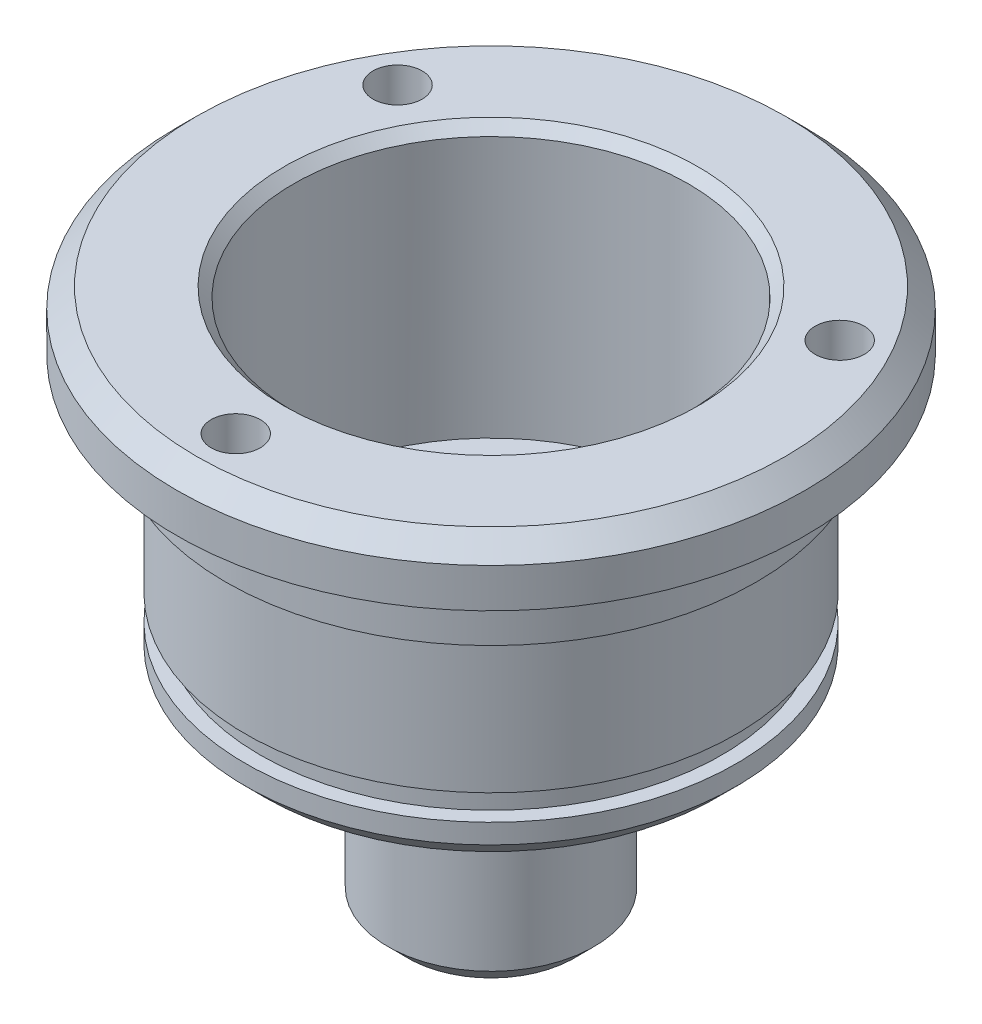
ISO-10303-21;
HEADER;
FILE_DESCRIPTION(('STEP AP214'),'2;1');
FILE_NAME('part.step','',(''),(''),'','','');
FILE_SCHEMA(('AUTOMOTIVE_DESIGN { 1 0 10303 214 1 1 1 1 }'));
ENDSEC;
DATA;
#1=APPLICATION_CONTEXT('core data for automotive mechanical design processes');
#2=APPLICATION_PROTOCOL_DEFINITION('international standard','automotive_design',2000,#1);
#3=PRODUCT_CONTEXT('',#1,'mechanical');
#4=PRODUCT('Part','Part','',(#3));
#5=PRODUCT_RELATED_PRODUCT_CATEGORY('part','',(#4));
#6=PRODUCT_DEFINITION_FORMATION('','',#4);
#7=PRODUCT_DEFINITION_CONTEXT('part definition',#1,'design');
#8=PRODUCT_DEFINITION('design','',#6,#7);
#9=PRODUCT_DEFINITION_SHAPE('','',#8);
#10=(LENGTH_UNIT() NAMED_UNIT(*) SI_UNIT(.MILLI.,.METRE.));
#11=(NAMED_UNIT(*) PLANE_ANGLE_UNIT() SI_UNIT($,.RADIAN.));
#12=(NAMED_UNIT(*) SI_UNIT($,.STERADIAN.) SOLID_ANGLE_UNIT());
#13=UNCERTAINTY_MEASURE_WITH_UNIT(LENGTH_MEASURE(1.E-05),#10,'distance_accuracy_value','');
#14=(GEOMETRIC_REPRESENTATION_CONTEXT(3) GLOBAL_UNCERTAINTY_ASSIGNED_CONTEXT((#13)) GLOBAL_UNIT_ASSIGNED_CONTEXT((#10,
#11,#12)) REPRESENTATION_CONTEXT('',''));
#15=CARTESIAN_POINT('',(0.,0.,0.));
#16=DIRECTION('',(0.,0.,1.));
#17=DIRECTION('',(1.,0.,0.));
#18=AXIS2_PLACEMENT_3D('',#15,#16,#17);
#19=CARTESIAN_POINT('',(0.,0.,0.));
#20=DIRECTION('',(0.,-1.,0.));
#21=DIRECTION('',(0.,0.,-1.));
#22=AXIS2_PLACEMENT_3D('',#19,#20,#21);
#23=CYLINDRICAL_SURFACE('',#22,10.05);
#24=CARTESIAN_POINT('',(0.,16.3,0.));
#25=DIRECTION('',(0.,1.,0.));
#26=DIRECTION('',(0.,0.,1.));
#27=AXIS2_PLACEMENT_3D('',#24,#25,#26);
#28=CIRCLE('',#27,10.05);
#29=CARTESIAN_POINT('',(0.,16.3,10.05));
#30=VERTEX_POINT('',#29);
#31=EDGE_CURVE('E11',#30,#30,#28,.T.);
#32=ORIENTED_EDGE('',*,*,#31,.T.);
#33=EDGE_LOOP('',(#32));
#34=FACE_BOUND('',#33,.T.);
#35=CARTESIAN_POINT('',(0.,3.,0.));
#36=DIRECTION('',(0.,-1.,0.));
#37=DIRECTION('',(0.,0.,-1.));
#38=AXIS2_PLACEMENT_3D('',#35,#36,#37);
#39=CIRCLE('',#38,10.05);
#40=CARTESIAN_POINT('',(0.,3.,-10.05));
#41=VERTEX_POINT('',#40);
#42=EDGE_CURVE('E176',#41,#41,#39,.T.);
#43=ORIENTED_EDGE('',*,*,#42,.T.);
#44=EDGE_LOOP('',(#43));
#45=FACE_BOUND('',#44,.T.);
#46=ADVANCED_FACE('F40',(#34,#45),#23,.F.);
#47=CARTESIAN_POINT('',(12.5,0.,0.));
#48=DIRECTION('',(0.,-1.,0.));
#49=DIRECTION('',(0.,0.,-1.));
#50=AXIS2_PLACEMENT_3D('',#47,#48,#49);
#51=PLANE('',#50);
#52=CARTESIAN_POINT('',(0.,0.,0.));
#53=DIRECTION('',(0.,-1.,0.));
#54=DIRECTION('',(0.,0.,-1.));
#55=AXIS2_PLACEMENT_3D('',#52,#53,#54);
#56=CIRCLE('',#55,5.45);
#57=CARTESIAN_POINT('',(0.,0.,-5.45));
#58=VERTEX_POINT('',#57);
#59=EDGE_CURVE('E160',#58,#58,#56,.F.);
#60=ORIENTED_EDGE('',*,*,#59,.T.);
#61=EDGE_LOOP('',(#60));
#62=FACE_BOUND('',#61,.T.);
#63=CARTESIAN_POINT('',(0.,0.,0.));
#64=DIRECTION('',(0.,-1.,0.));
#65=DIRECTION('',(0.,0.,-1.));
#66=AXIS2_PLACEMENT_3D('',#63,#64,#65);
#67=CIRCLE('',#66,11.5);
#68=CARTESIAN_POINT('',(0.,0.,-11.5));
#69=VERTEX_POINT('',#68);
#70=EDGE_CURVE('E258',#69,#69,#67,.T.);
#71=ORIENTED_EDGE('',*,*,#70,.T.);
#72=EDGE_LOOP('',(#71));
#73=FACE_BOUND('',#72,.T.);
#74=ADVANCED_FACE('F117',(#62,#73),#51,.T.);
#75=CARTESIAN_POINT('',(0.,0.,0.));
#76=DIRECTION('',(0.,-1.,0.));
#77=DIRECTION('',(0.,0.,-1.));
#78=AXIS2_PLACEMENT_3D('',#75,#76,#77);
#79=CYLINDRICAL_SURFACE('',#78,12.5);
#80=CARTESIAN_POINT('',(0.,1.00000000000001,0.));
#81=DIRECTION('',(0.,-1.,0.));
#82=DIRECTION('',(0.,0.,-1.));
#83=AXIS2_PLACEMENT_3D('',#80,#81,#82);
#84=CIRCLE('',#83,12.5);
#85=CARTESIAN_POINT('',(0.,1.00000000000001,-12.5));
#86=VERTEX_POINT('',#85);
#87=EDGE_CURVE('E261',#86,#86,#84,.F.);
#88=ORIENTED_EDGE('',*,*,#87,.T.);
#89=EDGE_LOOP('',(#88));
#90=FACE_BOUND('',#89,.T.);
#91=CARTESIAN_POINT('',(0.,2.,0.));
#92=DIRECTION('',(0.,-1.,0.));
#93=DIRECTION('',(0.,0.,-1.));
#94=AXIS2_PLACEMENT_3D('',#91,#92,#93);
#95=CIRCLE('',#94,12.5);
#96=CARTESIAN_POINT('',(0.,2.,-12.5));
#97=VERTEX_POINT('',#96);
#98=EDGE_CURVE('E255',#97,#97,#95,.T.);
#99=ORIENTED_EDGE('',*,*,#98,.T.);
#100=EDGE_LOOP('',(#99));
#101=FACE_BOUND('',#100,.T.);
#102=ADVANCED_FACE('F123',(#90,#101),#79,.T.);
#103=CARTESIAN_POINT('',(12.5,2.,0.));
#104=DIRECTION('',(0.,1.,0.));
#105=DIRECTION('',(0.,0.,1.));
#106=AXIS2_PLACEMENT_3D('',#103,#104,#105);
#107=PLANE('',#106);
#108=CARTESIAN_POINT('',(0.,2.,0.));
#109=DIRECTION('',(0.,-1.,0.));
#110=DIRECTION('',(0.,0.,-1.));
#111=AXIS2_PLACEMENT_3D('',#108,#109,#110);
#112=CIRCLE('',#111,11.75);
#113=CARTESIAN_POINT('',(0.,2.,-11.75));
#114=VERTEX_POINT('',#113);
#115=EDGE_CURVE('E252',#114,#114,#112,.T.);
#116=ORIENTED_EDGE('',*,*,#115,.T.);
#117=EDGE_LOOP('',(#116));
#118=FACE_BOUND('',#117,.T.);
#119=ORIENTED_EDGE('',*,*,#98,.F.);
#120=EDGE_LOOP('',(#119));
#121=FACE_BOUND('',#120,.T.);
#122=ADVANCED_FACE('F522',(#118,#121),#107,.T.);
#123=CARTESIAN_POINT('',(0.,0.,0.));
#124=DIRECTION('',(0.,-1.,0.));
#125=DIRECTION('',(0.,0.,-1.));
#126=AXIS2_PLACEMENT_3D('',#123,#124,#125);
#127=CYLINDRICAL_SURFACE('',#126,11.75);
#128=CARTESIAN_POINT('',(0.,3.3,0.));
#129=DIRECTION('',(0.,-1.,0.));
#130=DIRECTION('',(0.,0.,-1.));
#131=AXIS2_PLACEMENT_3D('',#128,#129,#130);
#132=CIRCLE('',#131,11.75);
#133=CARTESIAN_POINT('',(0.,3.3,-11.75));
#134=VERTEX_POINT('',#133);
#135=EDGE_CURVE('E249',#134,#134,#132,.T.);
#136=ORIENTED_EDGE('',*,*,#135,.T.);
#137=EDGE_LOOP('',(#136));
#138=FACE_BOUND('',#137,.T.);
#139=ORIENTED_EDGE('',*,*,#115,.F.);
#140=EDGE_LOOP('',(#139));
#141=FACE_BOUND('',#140,.T.);
#142=ADVANCED_FACE('F529',(#138,#141),#127,.T.);
#143=CARTESIAN_POINT('',(11.75,3.3,0.));
#144=DIRECTION('',(0.,-1.,0.));
#145=DIRECTION('',(0.,0.,-1.));
#146=AXIS2_PLACEMENT_3D('',#143,#144,#145);
#147=PLANE('',#146);
#148=CARTESIAN_POINT('',(0.,3.3,0.));
#149=DIRECTION('',(0.,-1.,0.));
#150=DIRECTION('',(0.,0.,-1.));
#151=AXIS2_PLACEMENT_3D('',#148,#149,#150);
#152=CIRCLE('',#151,12.5);
#153=CARTESIAN_POINT('',(0.,3.3,-12.5));
#154=VERTEX_POINT('',#153);
#155=EDGE_CURVE('E246',#154,#154,#152,.T.);
#156=ORIENTED_EDGE('',*,*,#155,.T.);
#157=EDGE_LOOP('',(#156));
#158=FACE_BOUND('',#157,.T.);
#159=ORIENTED_EDGE('',*,*,#135,.F.);
#160=EDGE_LOOP('',(#159));
#161=FACE_BOUND('',#160,.T.);
#162=ADVANCED_FACE('F537',(#158,#161),#147,.T.);
#163=CARTESIAN_POINT('',(0.,0.,0.));
#164=DIRECTION('',(0.,-1.,0.));
#165=DIRECTION('',(0.,0.,-1.));
#166=AXIS2_PLACEMENT_3D('',#163,#164,#165);
#167=CYLINDRICAL_SURFACE('',#166,12.5);
#168=CARTESIAN_POINT('',(0.,10.5,0.));
#169=DIRECTION('',(0.,-1.,0.));
#170=DIRECTION('',(0.,0.,-1.));
#171=AXIS2_PLACEMENT_3D('',#168,#169,#170);
#172=CIRCLE('',#171,12.5);
#173=CARTESIAN_POINT('',(0.,10.5,-12.5));
#174=VERTEX_POINT('',#173);
#175=EDGE_CURVE('E243',#174,#174,#172,.T.);
#176=ORIENTED_EDGE('',*,*,#175,.T.);
#177=EDGE_LOOP('',(#176));
#178=FACE_BOUND('',#177,.T.);
#179=ORIENTED_EDGE('',*,*,#155,.F.);
#180=EDGE_LOOP('',(#179));
#181=FACE_BOUND('',#180,.T.);
#182=ADVANCED_FACE('F545',(#178,#181),#167,.T.);
#183=CARTESIAN_POINT('',(12.5,10.5,0.));
#184=DIRECTION('',(0.,-1.,0.));
#185=DIRECTION('',(0.,0.,-1.));
#186=AXIS2_PLACEMENT_3D('',#183,#184,#185);
#187=PLANE('',#186);
#188=CARTESIAN_POINT('',(0.,10.5,0.));
#189=DIRECTION('',(0.,-1.,0.));
#190=DIRECTION('',(0.,0.,-1.));
#191=AXIS2_PLACEMENT_3D('',#188,#189,#190);
#192=CIRCLE('',#191,13.5);
#193=CARTESIAN_POINT('',(0.,10.5,-13.5));
#194=VERTEX_POINT('',#193);
#195=EDGE_CURVE('E239',#194,#194,#192,.T.);
#196=ORIENTED_EDGE('',*,*,#195,.T.);
#197=EDGE_LOOP('',(#196));
#198=FACE_BOUND('',#197,.T.);
#199=ORIENTED_EDGE('',*,*,#175,.F.);
#200=EDGE_LOOP('',(#199));
#201=FACE_BOUND('',#200,.T.);
#202=ADVANCED_FACE('F302',(#198,#201),#187,.T.);
#203=CARTESIAN_POINT('',(0.,0.,0.));
#204=DIRECTION('',(0.,-1.,0.));
#205=DIRECTION('',(0.,0.,-1.));
#206=AXIS2_PLACEMENT_3D('',#203,#204,#205);
#207=CYLINDRICAL_SURFACE('',#206,13.5);
#208=DIRECTION('',(0.,1.,0.));
#209=VECTOR('',#208,1.);
#210=CARTESIAN_POINT('',(12.2308132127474,14.8,-5.71464855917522));
#211=LINE('',#210,#209);
#212=CARTESIAN_POINT('',(12.2308132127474,13.8,-5.71464855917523));
#213=VERTEX_POINT('',#212);
#214=CARTESIAN_POINT('',(12.2308132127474,12.8,-5.71464855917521));
#215=VERTEX_POINT('',#214);
#216=EDGE_CURVE('E324',#213,#215,#211,.F.);
#217=ORIENTED_EDGE('',*,*,#216,.F.);
#218=CARTESIAN_POINT('',(0.,13.8,0.));
#219=DIRECTION('',(0.,-1.,0.));
#220=DIRECTION('',(0.,0.,-1.));
#221=AXIS2_PLACEMENT_3D('',#218,#219,#220);
#222=CIRCLE('',#221,13.5);
#223=CARTESIAN_POINT('',(1.16637578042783,13.8,13.4495192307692));
#224=VERTEX_POINT('',#223);
#225=EDGE_CURVE('E235',#213,#224,#222,.T.);
#226=ORIENTED_EDGE('',*,*,#225,.T.);
#227=DIRECTION('',(0.,1.,0.));
#228=VECTOR('',#227,1.);
#229=CARTESIAN_POINT('',(1.16637578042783,14.8,13.4495192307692));
#230=LINE('',#229,#228);
#231=CARTESIAN_POINT('',(1.16637578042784,12.8,13.4495192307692));
#232=VERTEX_POINT('',#231);
#233=EDGE_CURVE('E277',#232,#224,#230,.T.);
#234=ORIENTED_EDGE('',*,*,#233,.F.);
#235=CARTESIAN_POINT('',(-1.16674482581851,12.8002000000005,13.4494872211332));
#236=CARTESIAN_POINT('',(-1.11380571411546,12.7715435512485,13.4540783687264));
#237=CARTESIAN_POINT('',(-1.06073240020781,12.7430743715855,13.458368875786));
#238=CARTESIAN_POINT('',(-0.95409426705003,12.6868200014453,13.4663497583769));
#239=CARTESIAN_POINT('',(-0.900528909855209,12.6590357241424,13.4700393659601));
#240=CARTESIAN_POINT('',(-0.789883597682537,12.6030507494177,13.4769922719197));
#241=CARTESIAN_POINT('',(-0.732771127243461,12.5749098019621,13.4802214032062));
#242=CARTESIAN_POINT('',(-0.617583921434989,12.5206247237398,13.485989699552));
#243=CARTESIAN_POINT('',(-0.55950972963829,12.4944795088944,13.4885292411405));
#244=CARTESIAN_POINT('',(-0.469368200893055,12.457217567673,13.4918742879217));
#245=CARTESIAN_POINT('',(-0.437854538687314,12.4447956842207,13.4929349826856));
#246=CARTESIAN_POINT('',(-0.374262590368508,12.421414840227,13.4948486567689));
#247=CARTESIAN_POINT('',(-0.342184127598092,12.4104563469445,13.4957015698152));
#248=CARTESIAN_POINT('',(-0.277990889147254,12.3907893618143,13.4971749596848));
#249=CARTESIAN_POINT('',(-0.245888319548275,12.3820421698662,13.4977995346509));
#250=CARTESIAN_POINT('',(-0.18107037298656,12.3672769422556,13.4988244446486));
#251=CARTESIAN_POINT('',(-0.148355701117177,12.3612559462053,13.4992250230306));
#252=CARTESIAN_POINT('',(-0.0879934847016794,12.3533942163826,13.4997410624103));
#253=CARTESIAN_POINT('',(-0.0604170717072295,12.3510214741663,13.4998930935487));
#254=CARTESIAN_POINT('',(-0.0051677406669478,12.3489307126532,13.500027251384));
#255=CARTESIAN_POINT('',(0.0225051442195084,12.3492118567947,13.5000094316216));
#256=CARTESIAN_POINT('',(0.0781837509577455,12.3524230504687,13.4998028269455));
#257=CARTESIAN_POINT('',(0.106186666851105,12.3554000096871,13.499611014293));
#258=CARTESIAN_POINT('',(0.161826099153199,12.3637430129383,13.4990587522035));
#259=CARTESIAN_POINT('',(0.189462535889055,12.3691095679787,13.4986982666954));
#260=CARTESIAN_POINT('',(0.260613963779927,12.3855370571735,13.4975551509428));
#261=CARTESIAN_POINT('',(0.303777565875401,12.3980856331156,13.4966489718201));
#262=CARTESIAN_POINT('',(0.389058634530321,12.4263619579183,13.4944602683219));
#263=CARTESIAN_POINT('',(0.43117446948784,12.4420943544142,13.4931771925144));
#264=CARTESIAN_POINT('',(0.514836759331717,12.4756715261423,13.4902448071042));
#265=CARTESIAN_POINT('',(0.556378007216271,12.4935288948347,13.4885932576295));
#266=CARTESIAN_POINT('',(0.638818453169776,12.5305539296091,13.4849401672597));
#267=CARTESIAN_POINT('',(0.67971802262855,12.5497208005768,13.4829388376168));
#268=CARTESIAN_POINT('',(0.796436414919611,12.6059613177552,13.4767018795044));
#269=CARTESIAN_POINT('',(0.871707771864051,12.6441190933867,13.4720361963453));
#270=CARTESIAN_POINT('',(0.983427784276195,12.7022524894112,13.4641833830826));
#271=CARTESIAN_POINT('',(1.02022019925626,12.7216430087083,13.4614451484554));
#272=CARTESIAN_POINT('',(1.09361378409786,12.7607186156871,13.4556814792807));
#273=CARTESIAN_POINT('',(1.13021500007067,12.7804036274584,13.4526561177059));
#274=CARTESIAN_POINT('',(1.16674482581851,12.8002000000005,13.4494872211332));
#275=B_SPLINE_CURVE_WITH_KNOTS('',3,(#235,#236,#237,#238,#239,#240,#241,#242,#243,#244,#245,
#246,#247,#248,#249,#250,#251,#252,#253,#254,#255,#256,#257,#258,#259,#260,#261,#262,#263,#264,
#265,#266,#267,#268,#269,#270,#271,#272,#273,#274),.UNSPECIFIED.,.F.,.F.,(4,2,2,2,2,2,2,2,2,2,2,
2,2,2,2,2,2,2,2,4),(0.,0.181125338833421,0.362480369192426,0.553713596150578,0.74484219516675,
0.846487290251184,0.9481647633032,1.04791557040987,1.14755779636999,1.23047578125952,
1.31336762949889,1.39773018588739,1.4821107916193,1.61677285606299,1.75163293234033,
1.88733628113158,2.02295795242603,2.27645936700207,2.40149695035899,2.52650284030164),.UNSPECIFIED.);
#276=CARTESIAN_POINT('',(-1.16637578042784,12.8,13.4495192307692));
#277=VERTEX_POINT('',#276);
#278=EDGE_CURVE('E270',#277,#232,#275,.T.);
#279=ORIENTED_EDGE('',*,*,#278,.F.);
#280=DIRECTION('',(0.,1.,0.));
#281=VECTOR('',#280,1.);
#282=CARTESIAN_POINT('',(-1.16637578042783,14.8,13.4495192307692));
#283=LINE('',#282,#281);
#284=CARTESIAN_POINT('',(-1.16637578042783,13.8,13.4495192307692));
#285=VERTEX_POINT('',#284);
#286=EDGE_CURVE('E330',#285,#277,#283,.F.);
#287=ORIENTED_EDGE('',*,*,#286,.F.);
#288=CARTESIAN_POINT('',(-12.2308132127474,13.8,-5.71464855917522));
#289=VERTEX_POINT('',#288);
#290=EDGE_CURVE('E236',#285,#289,#222,.T.);
#291=ORIENTED_EDGE('',*,*,#290,.T.);
#292=DIRECTION('',(0.,1.,0.));
#293=VECTOR('',#292,1.);
#294=CARTESIAN_POINT('',(-12.2308132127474,14.8,-5.71464855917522));
#295=LINE('',#294,#293);
#296=CARTESIAN_POINT('',(-12.2308132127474,12.8,-5.71464855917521));
#297=VERTEX_POINT('',#296);
#298=EDGE_CURVE('E333',#297,#289,#295,.T.);
#299=ORIENTED_EDGE('',*,*,#298,.F.);
#300=CARTESIAN_POINT('',(-11.0642251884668,12.8002,-7.73517426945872));
#301=CARTESIAN_POINT('',(-11.0946707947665,12.771543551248,-7.6916232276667));
#302=CARTESIAN_POINT('',(-11.1249231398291,12.7430743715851,-7.64780564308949));
#303=CARTESIAN_POINT('',(-11.1851538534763,12.6868200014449,-7.55944475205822));
#304=CARTESIAN_POINT('',(-11.2151318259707,12.6590357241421,-7.51490059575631));
#305=CARTESIAN_POINT('',(-11.2764758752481,12.6030507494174,-7.42255539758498));
#306=CARTESIAN_POINT('',(-11.3078286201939,12.5749098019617,-7.37470911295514));
#307=CARTESIAN_POINT('',(-11.3704177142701,12.5206247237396,-7.27783821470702));
#308=CARTESIAN_POINT('',(-11.401654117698,12.4944795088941,-7.2288142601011));
#309=CARTESIAN_POINT('',(-11.44962177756,12.4572175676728,-7.15242192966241));
#310=CARTESIAN_POINT('',(-11.4662971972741,12.4447956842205,-7.12566064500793));
#311=CARTESIAN_POINT('',(-11.4997504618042,12.4214148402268,-7.07154523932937));
#312=CARTESIAN_POINT('',(-11.5165283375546,12.4104563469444,-7.04419093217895));
#313=CARTESIAN_POINT('',(-11.5499009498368,12.3907893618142,-6.98933465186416));
#314=CARTESIAN_POINT('',(-11.5664931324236,12.3820421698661,-6.96184529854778));
#315=CARTESIAN_POINT('',(-11.599789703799,12.3672769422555,-6.90622376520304));
#316=CARTESIAN_POINT('',(-11.6164939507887,12.3612559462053,-6.87809231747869));
#317=CARTESIAN_POINT('',(-11.6471219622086,12.3533942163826,-6.82607512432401));
#318=CARTESIAN_POINT('',(-11.6610418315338,12.3510214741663,-6.80226926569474));
#319=CARTESIAN_POINT('',(-11.6887826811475,12.3489307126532,-6.75448902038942));
#320=CARTESIAN_POINT('',(-11.7026036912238,12.3492118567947,-6.73051468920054));
#321=CARTESIAN_POINT('',(-11.7302640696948,12.3524230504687,-6.6821922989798));
#322=CARTESIAN_POINT('',(-11.7440994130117,12.3554000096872,-6.65784515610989));
#323=CARTESIAN_POINT('',(-11.7714408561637,12.3637430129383,-6.60938386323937));
#324=CARTESIAN_POINT('',(-11.784946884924,12.3691095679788,-6.58526976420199));
#325=CARTESIAN_POINT('',(-11.8195326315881,12.3855370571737,-6.5230792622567));
#326=CARTESIAN_POINT('',(-11.8403296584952,12.3980856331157,-6.48524539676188));
#327=CARTESIAN_POINT('',(-11.8810747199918,12.4263619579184,-6.41029547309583));
#328=CARTESIAN_POINT('',(-11.9010214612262,12.4420943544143,-6.37318055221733));
#329=CARTESIAN_POINT('',(-11.9403130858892,12.4756715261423,-6.29926069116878));
#330=CARTESIAN_POINT('',(-11.9596534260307,12.4935288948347,-6.26245914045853));
#331=CARTESIAN_POINT('',(-11.9977099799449,12.5305539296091,-6.1892370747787));
#332=CARTESIAN_POINT('',(-12.0164265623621,12.5497208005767,-6.15281634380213));
#333=CARTESIAN_POINT('',(-12.06938439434,12.605961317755,-6.0486167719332));
#334=CARTESIAN_POINT('',(-12.1029794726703,12.6441190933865,-5.98109702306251));
#335=CARTESIAN_POINT('',(-12.1520387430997,12.7022524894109,-5.88041824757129));
#336=CARTESIAN_POINT('',(-12.168063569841,12.721643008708,-5.84718596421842));
#337=CARTESIAN_POINT('',(-12.1997688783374,12.7607186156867,-5.7807434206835));
#338=CARTESIAN_POINT('',(-12.2154494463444,12.7804036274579,-5.7475331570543));
#339=CARTESIAN_POINT('',(-12.2309700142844,12.8002,-5.71431295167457));
#340=B_SPLINE_CURVE_WITH_KNOTS('',3,(#300,#301,#302,#303,#304,#305,#306,#307,#308,#309,#310,
#311,#312,#313,#314,#315,#316,#317,#318,#319,#320,#321,#322,#323,#324,#325,#326,#327,#328,#329,
#330,#331,#332,#333,#334,#335,#336,#337,#338,#339),.UNSPECIFIED.,.F.,.F.,(4,2,2,2,2,2,2,2,2,2,2,
2,2,2,2,2,2,2,2,4),(0.,0.181125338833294,0.362480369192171,0.553713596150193,0.744842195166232,
0.846487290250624,0.948164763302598,1.04791557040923,1.1475577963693,1.23047578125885,
1.31336762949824,1.39773018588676,1.48211079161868,1.61677285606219,1.75163293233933,
1.88733628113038,2.02295795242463,2.27645936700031,2.40149695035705,2.52650284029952),.UNSPECIFIED.);
#341=CARTESIAN_POINT('',(-11.0644374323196,12.8,-7.73487067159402));
#342=VERTEX_POINT('',#341);
#343=EDGE_CURVE('E334',#342,#297,#340,.T.);
#344=ORIENTED_EDGE('',*,*,#343,.F.);
#345=DIRECTION('',(0.,1.,0.));
#346=VECTOR('',#345,1.);
#347=CARTESIAN_POINT('',(-11.0644374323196,14.8,-7.73487067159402));
#348=LINE('',#347,#346);
#349=CARTESIAN_POINT('',(-11.0644374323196,13.8,-7.73487067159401));
#350=VERTEX_POINT('',#349);
#351=EDGE_CURVE('E320',#350,#342,#348,.F.);
#352=ORIENTED_EDGE('',*,*,#351,.F.);
#353=CARTESIAN_POINT('',(11.0644374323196,13.8,-7.73487067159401));
#354=VERTEX_POINT('',#353);
#355=EDGE_CURVE('E240',#350,#354,#222,.T.);
#356=ORIENTED_EDGE('',*,*,#355,.T.);
#357=DIRECTION('',(0.,1.,0.));
#358=VECTOR('',#357,1.);
#359=CARTESIAN_POINT('',(11.0644374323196,14.8,-7.73487067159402));
#360=LINE('',#359,#358);
#361=CARTESIAN_POINT('',(11.0644374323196,12.8,-7.73487067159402));
#362=VERTEX_POINT('',#361);
#363=EDGE_CURVE('E318',#362,#354,#360,.T.);
#364=ORIENTED_EDGE('',*,*,#363,.F.);
#365=CARTESIAN_POINT('',(12.2309700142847,12.8002000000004,-5.71431295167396));
#366=CARTESIAN_POINT('',(12.2084765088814,12.7715435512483,-5.76245514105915));
#367=CARTESIAN_POINT('',(12.1856555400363,12.7430743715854,-5.81056323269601));
#368=CARTESIAN_POINT('',(12.1392481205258,12.6868200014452,-5.90690500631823));
#369=CARTESIAN_POINT('',(12.1156607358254,12.6590357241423,-5.9551387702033));
#370=CARTESIAN_POINT('',(12.0663594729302,12.6030507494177,-6.05443687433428));
#371=CARTESIAN_POINT('',(12.0405997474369,12.574909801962,-6.10551229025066));
#372=CARTESIAN_POINT('',(11.9880016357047,12.5206247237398,-6.20815148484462));
#373=CARTESIAN_POINT('',(11.961163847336,12.4944795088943,-6.25971498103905));
#374=CARTESIAN_POINT('',(11.9189899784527,12.4572175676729,-6.33945235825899));
#375=CARTESIAN_POINT('',(11.9041517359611,12.4447956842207,-6.3672743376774));
#376=CARTESIAN_POINT('',(11.8740130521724,12.4214148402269,-6.42330341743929));
#377=CARTESIAN_POINT('',(11.8587124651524,12.4104563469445,-6.45151063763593));
#378=CARTESIAN_POINT('',(11.8278918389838,12.3907893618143,-6.50784030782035));
#379=CARTESIAN_POINT('',(11.8123814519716,12.3820421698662,-6.53595423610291));
#380=CARTESIAN_POINT('',(11.7808600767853,12.3672769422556,-6.59260067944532));
#381=CARTESIAN_POINT('',(11.7648496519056,12.3612559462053,-6.62113270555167));
#382=CARTESIAN_POINT('',(11.7351154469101,12.3533942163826,-6.6736659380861));
#383=CARTESIAN_POINT('',(11.7214589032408,12.3510214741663,-6.69762382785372));
#384=CARTESIAN_POINT('',(11.6939504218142,12.3489307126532,-6.74553823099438));
#385=CARTESIAN_POINT('',(11.680098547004,12.3492118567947,-6.76949474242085));
#386=CARTESIAN_POINT('',(11.6520803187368,12.3524230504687,-6.8176105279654));
#387=CARTESIAN_POINT('',(11.6379127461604,12.3554000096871,-6.84176585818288));
#388=CARTESIAN_POINT('',(11.6096147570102,12.3637430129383,-6.88967488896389));
#389=CARTESIAN_POINT('',(11.5954843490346,12.3691095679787,-6.91342850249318));
#390=CARTESIAN_POINT('',(11.558918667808,12.3855370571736,-6.97447588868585));
#391=CARTESIAN_POINT('',(11.5365520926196,12.3980856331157,-7.01140357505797));
#392=CARTESIAN_POINT('',(11.4920160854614,12.4263619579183,-7.08416479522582));
#393=CARTESIAN_POINT('',(11.4698469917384,12.4420943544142,-7.11999664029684));
#394=CARTESIAN_POINT('',(11.4254763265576,12.4756715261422,-7.19098411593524));
#395=CARTESIAN_POINT('',(11.4032754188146,12.4935288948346,-7.22613411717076));
#396=CARTESIAN_POINT('',(11.3588915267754,12.530553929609,-7.29570309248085));
#397=CARTESIAN_POINT('',(11.3367085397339,12.5497208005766,-7.33012249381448));
#398=CARTESIAN_POINT('',(11.2729479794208,12.6059613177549,-7.42808510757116));
#399=CARTESIAN_POINT('',(11.2312717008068,12.6441190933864,-7.49093917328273));
#400=CARTESIAN_POINT('',(11.1686109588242,12.7022524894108,-7.58376513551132));
#401=CARTESIAN_POINT('',(11.1478433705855,12.7216430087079,-7.61425918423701));
#402=CARTESIAN_POINT('',(11.1061550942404,12.7607186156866,-7.6749380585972));
#403=CARTESIAN_POINT('',(11.0852344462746,12.7804036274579,-7.70512296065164));
#404=CARTESIAN_POINT('',(11.0642251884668,12.8002,-7.73517426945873));
#405=B_SPLINE_CURVE_WITH_KNOTS('',3,(#365,#366,#367,#368,#369,#370,#371,#372,#373,#374,#375,
#376,#377,#378,#379,#380,#381,#382,#383,#384,#385,#386,#387,#388,#389,#390,#391,#392,#393,#394,
#395,#396,#397,#398,#399,#400,#401,#402,#403,#404),.UNSPECIFIED.,.F.,.F.,(4,2,2,2,2,2,2,2,2,2,2,
2,2,2,2,2,2,2,2,4),(0.,0.181125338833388,0.362480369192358,0.553713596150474,0.744842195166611,
0.846487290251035,0.948164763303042,1.0479155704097,1.14755779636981,1.23047578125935,
1.31336762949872,1.39773018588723,1.48211079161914,1.61677285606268,1.75163293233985,
1.88733628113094,2.02295795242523,2.27645936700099,2.40149695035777,2.52650284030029),.UNSPECIFIED.);
#406=EDGE_CURVE('E348',#215,#362,#405,.T.);
#407=ORIENTED_EDGE('',*,*,#406,.F.);
#408=EDGE_LOOP('',(#217,#226,#234,#279,#287,#291,#299,#344,#352,#356,#364,#407));
#409=FACE_BOUND('',#408,.T.);
#410=ORIENTED_EDGE('',*,*,#195,.F.);
#411=EDGE_LOOP('',(#410));
#412=FACE_BOUND('',#411,.T.);
#413=ADVANCED_FACE('F279',(#409,#412),#207,.T.);
#414=CARTESIAN_POINT('',(13.5,13.8,0.));
#415=DIRECTION('',(0.,-1.,0.));
#416=DIRECTION('',(0.,0.,-1.));
#417=AXIS2_PLACEMENT_3D('',#414,#415,#416);
#418=PLANE('',#417);
#419=CARTESIAN_POINT('',(11.2583302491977,13.8,-6.5));
#420=DIRECTION('',(0.,-1.,0.));
#421=DIRECTION('',(0.,0.,-1.));
#422=AXIS2_PLACEMENT_3D('',#419,#420,#421);
#423=CIRCLE('',#422,1.24999999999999);
#424=EDGE_CURVE('E217',#354,#213,#423,.T.);
#425=ORIENTED_EDGE('',*,*,#424,.F.);
#426=ORIENTED_EDGE('',*,*,#355,.F.);
#427=CARTESIAN_POINT('',(-11.2583302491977,13.8,-6.5));
#428=DIRECTION('',(0.,-1.,0.));
#429=DIRECTION('',(0.,0.,-1.));
#430=AXIS2_PLACEMENT_3D('',#427,#428,#429);
#431=CIRCLE('',#430,1.24999999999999);
#432=EDGE_CURVE('E223',#289,#350,#431,.T.);
#433=ORIENTED_EDGE('',*,*,#432,.F.);
#434=ORIENTED_EDGE('',*,*,#290,.F.);
#435=CARTESIAN_POINT('',(0.,13.8,13.));
#436=DIRECTION('',(0.,-1.,0.));
#437=DIRECTION('',(0.,0.,-1.));
#438=AXIS2_PLACEMENT_3D('',#435,#436,#437);
#439=CIRCLE('',#438,1.24999999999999);
#440=EDGE_CURVE('E230',#224,#285,#439,.T.);
#441=ORIENTED_EDGE('',*,*,#440,.F.);
#442=ORIENTED_EDGE('',*,*,#225,.F.);
#443=EDGE_LOOP('',(#425,#426,#433,#434,#441,#442));
#444=FACE_BOUND('',#443,.T.);
#445=CARTESIAN_POINT('',(0.,13.8,0.));
#446=DIRECTION('',(0.,-1.,0.));
#447=DIRECTION('',(0.,0.,-1.));
#448=AXIS2_PLACEMENT_3D('',#445,#446,#447);
#449=CIRCLE('',#448,16.);
#450=CARTESIAN_POINT('',(0.,13.8,-16.));
#451=VERTEX_POINT('',#450);
#452=EDGE_CURVE('E232',#451,#451,#449,.T.);
#453=ORIENTED_EDGE('',*,*,#452,.T.);
#454=EDGE_LOOP('',(#453));
#455=FACE_BOUND('',#454,.T.);
#456=ADVANCED_FACE('F295',(#444,#455),#418,.T.);
#457=CARTESIAN_POINT('',(0.,0.,0.));
#458=DIRECTION('',(0.,-1.,0.));
#459=DIRECTION('',(0.,0.,-1.));
#460=AXIS2_PLACEMENT_3D('',#457,#458,#459);
#461=CYLINDRICAL_SURFACE('',#460,16.);
#462=CARTESIAN_POINT('',(0.,15.8,0.));
#463=DIRECTION('',(0.,1.,0.));
#464=DIRECTION('',(0.,0.,1.));
#465=AXIS2_PLACEMENT_3D('',#462,#463,#464);
#466=CIRCLE('',#465,16.);
#467=CARTESIAN_POINT('',(0.,15.8,16.));
#468=VERTEX_POINT('',#467);
#469=EDGE_CURVE('E264',#468,#468,#466,.F.);
#470=ORIENTED_EDGE('',*,*,#469,.T.);
#471=EDGE_LOOP('',(#470));
#472=FACE_BOUND('',#471,.T.);
#473=ORIENTED_EDGE('',*,*,#452,.F.);
#474=EDGE_LOOP('',(#473));
#475=FACE_BOUND('',#474,.T.);
#476=ADVANCED_FACE('F292',(#472,#475),#461,.T.);
#477=CARTESIAN_POINT('',(16.,16.8,0.));
#478=DIRECTION('',(0.,1.,0.));
#479=DIRECTION('',(0.,0.,1.));
#480=AXIS2_PLACEMENT_3D('',#477,#478,#479);
#481=PLANE('',#480);
#482=CARTESIAN_POINT('',(0.,16.8,0.));
#483=DIRECTION('',(0.,1.,0.));
#484=DIRECTION('',(0.,0.,1.));
#485=AXIS2_PLACEMENT_3D('',#482,#483,#484);
#486=CIRCLE('',#485,10.55);
#487=CARTESIAN_POINT('',(0.,16.8,10.55));
#488=VERTEX_POINT('',#487);
#489=EDGE_CURVE('E48',#488,#488,#486,.F.);
#490=ORIENTED_EDGE('',*,*,#489,.T.);
#491=EDGE_LOOP('',(#490));
#492=FACE_BOUND('',#491,.T.);
#493=CARTESIAN_POINT('',(11.2583302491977,16.8,-6.5));
#494=DIRECTION('',(0.,1.,0.));
#495=DIRECTION('',(0.,0.,1.));
#496=AXIS2_PLACEMENT_3D('',#493,#494,#495);
#497=CIRCLE('',#496,1.24999999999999);
#498=CARTESIAN_POINT('',(11.2583302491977,16.8,-5.25000000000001));
#499=VERTEX_POINT('',#498);
#500=EDGE_CURVE('E212',#499,#499,#497,.T.);
#501=ORIENTED_EDGE('',*,*,#500,.F.);
#502=EDGE_LOOP('',(#501));
#503=FACE_BOUND('',#502,.T.);
#504=CARTESIAN_POINT('',(-11.2583302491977,16.8,-6.5));
#505=DIRECTION('',(0.,1.,0.));
#506=DIRECTION('',(0.,0.,1.));
#507=AXIS2_PLACEMENT_3D('',#504,#505,#506);
#508=CIRCLE('',#507,1.24999999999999);
#509=CARTESIAN_POINT('',(-11.2583302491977,16.8,-5.25000000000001));
#510=VERTEX_POINT('',#509);
#511=EDGE_CURVE('E219',#510,#510,#508,.T.);
#512=ORIENTED_EDGE('',*,*,#511,.F.);
#513=EDGE_LOOP('',(#512));
#514=FACE_BOUND('',#513,.T.);
#515=CARTESIAN_POINT('',(0.,16.8,13.));
#516=DIRECTION('',(0.,1.,0.));
#517=DIRECTION('',(0.,0.,1.));
#518=AXIS2_PLACEMENT_3D('',#515,#516,#517);
#519=CIRCLE('',#518,1.24999999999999);
#520=CARTESIAN_POINT('',(0.,16.8,14.25));
#521=VERTEX_POINT('',#520);
#522=EDGE_CURVE('E225',#521,#521,#519,.T.);
#523=ORIENTED_EDGE('',*,*,#522,.F.);
#524=EDGE_LOOP('',(#523));
#525=FACE_BOUND('',#524,.T.);
#526=CARTESIAN_POINT('',(0.,16.8,0.));
#527=DIRECTION('',(0.,1.,0.));
#528=DIRECTION('',(0.,0.,1.));
#529=AXIS2_PLACEMENT_3D('',#526,#527,#528);
#530=CIRCLE('',#529,15.);
#531=CARTESIAN_POINT('',(0.,16.8,15.));
#532=VERTEX_POINT('',#531);
#533=EDGE_CURVE('E267',#532,#532,#530,.T.);
#534=ORIENTED_EDGE('',*,*,#533,.T.);
#535=EDGE_LOOP('',(#534));
#536=FACE_BOUND('',#535,.T.);
#537=ADVANCED_FACE('F133',(#492,#503,#514,#525,#536),#481,.T.);
#538=CARTESIAN_POINT('',(0.,0.,0.));
#539=DIRECTION('',(0.,1.,0.));
#540=DIRECTION('',(0.,0.,1.));
#541=AXIS2_PLACEMENT_3D('',#538,#539,#540);
#542=CONICAL_SURFACE('',#541,11.5,0.785398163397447);
#543=ORIENTED_EDGE('',*,*,#87,.F.);
#544=EDGE_LOOP('',(#543));
#545=FACE_BOUND('',#544,.T.);
#546=ORIENTED_EDGE('',*,*,#70,.F.);
#547=EDGE_LOOP('',(#546));
#548=FACE_BOUND('',#547,.T.);
#549=ADVANCED_FACE('F129',(#545,#548),#542,.T.);
#550=CARTESIAN_POINT('',(0.,15.8,0.));
#551=DIRECTION('',(0.,-1.,0.));
#552=DIRECTION('',(0.,0.,-1.));
#553=AXIS2_PLACEMENT_3D('',#550,#551,#552);
#554=CONICAL_SURFACE('',#553,16.,0.785398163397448);
#555=ORIENTED_EDGE('',*,*,#533,.F.);
#556=EDGE_LOOP('',(#555));
#557=FACE_BOUND('',#556,.T.);
#558=ORIENTED_EDGE('',*,*,#469,.F.);
#559=EDGE_LOOP('',(#558));
#560=FACE_BOUND('',#559,.T.);
#561=ADVANCED_FACE('F132',(#557,#560),#554,.T.);
#562=CARTESIAN_POINT('',(0.,12.8,13.));
#563=DIRECTION('',(0.,1.,0.));
#564=DIRECTION('',(0.,0.,1.));
#565=AXIS2_PLACEMENT_3D('',#562,#563,#564);
#566=CONICAL_SURFACE('',#565,1.25,1.02974425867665);
#567=ORIENTED_EDGE('',*,*,#278,.T.);
#568=CARTESIAN_POINT('',(0.,12.8,13.));
#569=DIRECTION('',(0.,1.,0.));
#570=DIRECTION('',(0.,0.,1.));
#571=AXIS2_PLACEMENT_3D('',#568,#569,#570);
#572=CIRCLE('',#571,1.25);
#573=EDGE_CURVE('E228',#232,#277,#572,.T.);
#574=ORIENTED_EDGE('',*,*,#573,.T.);
#575=EDGE_LOOP('',(#567,#574));
#576=FACE_BOUND('',#575,.T.);
#577=CARTESIAN_POINT('',(0.,12.0489242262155,13.));
#578=VERTEX_POINT('',#577);
#579=VERTEX_LOOP('',#578);
#580=FACE_BOUND('',#579,.T.);
#581=ADVANCED_FACE('F137',(#576,#580),#566,.F.);
#582=CARTESIAN_POINT('',(0.,16.8,13.));
#583=DIRECTION('',(0.,1.,0.));
#584=DIRECTION('',(0.,0.,1.));
#585=AXIS2_PLACEMENT_3D('',#582,#583,#584);
#586=CYLINDRICAL_SURFACE('',#585,1.24999999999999);
#587=ORIENTED_EDGE('',*,*,#286,.T.);
#588=ORIENTED_EDGE('',*,*,#573,.F.);
#589=ORIENTED_EDGE('',*,*,#233,.T.);
#590=ORIENTED_EDGE('',*,*,#440,.T.);
#591=EDGE_LOOP('',(#587,#588,#589,#590));
#592=FACE_BOUND('',#591,.T.);
#593=ORIENTED_EDGE('',*,*,#522,.T.);
#594=EDGE_LOOP('',(#593));
#595=FACE_BOUND('',#594,.T.);
#596=ADVANCED_FACE('F287',(#592,#595),#586,.F.);
#597=CARTESIAN_POINT('',(-11.2583302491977,12.8,-6.5));
#598=DIRECTION('',(0.,1.,0.));
#599=DIRECTION('',(0.,0.,1.));
#600=AXIS2_PLACEMENT_3D('',#597,#598,#599);
#601=CONICAL_SURFACE('',#600,1.25,1.02974425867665);
#602=ORIENTED_EDGE('',*,*,#343,.T.);
#603=CARTESIAN_POINT('',(-11.2583302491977,12.8,-6.5));
#604=DIRECTION('',(0.,1.,0.));
#605=DIRECTION('',(0.,0.,1.));
#606=AXIS2_PLACEMENT_3D('',#603,#604,#605);
#607=CIRCLE('',#606,1.25);
#608=EDGE_CURVE('E61',#297,#342,#607,.T.);
#609=ORIENTED_EDGE('',*,*,#608,.T.);
#610=EDGE_LOOP('',(#602,#609));
#611=FACE_BOUND('',#610,.T.);
#612=CARTESIAN_POINT('',(-11.2583302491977,12.0489242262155,-6.5));
#613=VERTEX_POINT('',#612);
#614=VERTEX_LOOP('',#613);
#615=FACE_BOUND('',#614,.T.);
#616=ADVANCED_FACE('F112',(#611,#615),#601,.F.);
#617=CARTESIAN_POINT('',(-11.2583302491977,16.8,-6.5));
#618=DIRECTION('',(0.,1.,0.));
#619=DIRECTION('',(0.,0.,1.));
#620=AXIS2_PLACEMENT_3D('',#617,#618,#619);
#621=CYLINDRICAL_SURFACE('',#620,1.24999999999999);
#622=ORIENTED_EDGE('',*,*,#351,.T.);
#623=ORIENTED_EDGE('',*,*,#608,.F.);
#624=ORIENTED_EDGE('',*,*,#298,.T.);
#625=ORIENTED_EDGE('',*,*,#432,.T.);
#626=EDGE_LOOP('',(#622,#623,#624,#625));
#627=FACE_BOUND('',#626,.T.);
#628=ORIENTED_EDGE('',*,*,#511,.T.);
#629=EDGE_LOOP('',(#628));
#630=FACE_BOUND('',#629,.T.);
#631=ADVANCED_FACE('F103',(#627,#630),#621,.F.);
#632=CARTESIAN_POINT('',(11.2583302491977,12.8,-6.5));
#633=DIRECTION('',(0.,1.,0.));
#634=DIRECTION('',(0.,0.,1.));
#635=AXIS2_PLACEMENT_3D('',#632,#633,#634);
#636=CONICAL_SURFACE('',#635,1.25,1.02974425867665);
#637=ORIENTED_EDGE('',*,*,#406,.T.);
#638=CARTESIAN_POINT('',(11.2583302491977,12.8,-6.5));
#639=DIRECTION('',(0.,1.,0.));
#640=DIRECTION('',(0.,0.,1.));
#641=AXIS2_PLACEMENT_3D('',#638,#639,#640);
#642=CIRCLE('',#641,1.25);
#643=EDGE_CURVE('E54',#362,#215,#642,.T.);
#644=ORIENTED_EDGE('',*,*,#643,.T.);
#645=EDGE_LOOP('',(#637,#644));
#646=FACE_BOUND('',#645,.T.);
#647=CARTESIAN_POINT('',(11.2583302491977,12.0489242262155,-6.5));
#648=VERTEX_POINT('',#647);
#649=VERTEX_LOOP('',#648);
#650=FACE_BOUND('',#649,.T.);
#651=ADVANCED_FACE('F100',(#646,#650),#636,.F.);
#652=CARTESIAN_POINT('',(11.2583302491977,16.8,-6.5));
#653=DIRECTION('',(0.,1.,0.));
#654=DIRECTION('',(0.,0.,1.));
#655=AXIS2_PLACEMENT_3D('',#652,#653,#654);
#656=CYLINDRICAL_SURFACE('',#655,1.24999999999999);
#657=ORIENTED_EDGE('',*,*,#216,.T.);
#658=ORIENTED_EDGE('',*,*,#643,.F.);
#659=ORIENTED_EDGE('',*,*,#363,.T.);
#660=ORIENTED_EDGE('',*,*,#424,.T.);
#661=EDGE_LOOP('',(#657,#658,#659,#660));
#662=FACE_BOUND('',#661,.T.);
#663=ORIENTED_EDGE('',*,*,#500,.T.);
#664=EDGE_LOOP('',(#663));
#665=FACE_BOUND('',#664,.T.);
#666=ADVANCED_FACE('F102',(#662,#665),#656,.F.);
#667=CARTESIAN_POINT('',(0.,3.,0.));
#668=DIRECTION('',(0.,-1.,0.));
#669=DIRECTION('',(0.,0.,-1.));
#670=AXIS2_PLACEMENT_3D('',#667,#668,#669);
#671=PLANE('',#670);
#672=CARTESIAN_POINT('',(0.,3.,0.));
#673=DIRECTION('',(0.,-1.,0.));
#674=DIRECTION('',(0.,0.,-1.));
#675=AXIS2_PLACEMENT_3D('',#672,#673,#674);
#676=CIRCLE('',#675,2.75);
#677=CARTESIAN_POINT('',(0.,3.,-2.75));
#678=VERTEX_POINT('',#677);
#679=EDGE_CURVE('E209',#678,#678,#676,.T.);
#680=ORIENTED_EDGE('',*,*,#679,.T.);
#681=EDGE_LOOP('',(#680));
#682=FACE_BOUND('',#681,.T.);
#683=ORIENTED_EDGE('',*,*,#42,.F.);
#684=EDGE_LOOP('',(#683));
#685=FACE_BOUND('',#684,.T.);
#686=ADVANCED_FACE('F109',(#682,#685),#671,.F.);
#687=CARTESIAN_POINT('',(0.,0.,0.));
#688=DIRECTION('',(0.,1.,0.));
#689=DIRECTION('',(0.,0.,1.));
#690=AXIS2_PLACEMENT_3D('',#687,#688,#689);
#691=CYLINDRICAL_SURFACE('',#690,5.25);
#692=CARTESIAN_POINT('',(1.5,-7.7,-5.03115294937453));
#693=CARTESIAN_POINT('',(1.49999851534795,-7.78238865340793,-5.03115410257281));
#694=CARTESIAN_POINT('',(1.49318899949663,-7.86479231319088,-5.03319884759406));
#695=CARTESIAN_POINT('',(1.46619272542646,-8.02720342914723,-5.04112791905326));
#696=CARTESIAN_POINT('',(1.4460005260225,-8.10720989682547,-5.04701380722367));
#697=CARTESIAN_POINT('',(1.3929700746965,-8.26245290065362,-5.06190532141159));
#698=CARTESIAN_POINT('',(1.36015140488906,-8.33769661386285,-5.07090611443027));
#699=CARTESIAN_POINT('',(1.28286273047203,-8.48162585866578,-5.09100690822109));
#700=CARTESIAN_POINT('',(1.2383913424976,-8.55031061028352,-5.10210715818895));
#701=CARTESIAN_POINT('',(1.13769360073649,-8.68114367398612,-5.12551337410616));
#702=CARTESIAN_POINT('',(1.08119190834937,-8.74307585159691,-5.13784316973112));
#703=CARTESIAN_POINT('',(0.958628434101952,-8.85672708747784,-5.16211474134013));
#704=CARTESIAN_POINT('',(0.892565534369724,-8.90844494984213,-5.17405647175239));
#705=CARTESIAN_POINT('',(0.751234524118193,-9.00112148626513,-5.19647499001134));
#706=CARTESIAN_POINT('',(0.6758180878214,-9.04186221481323,-5.2069204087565));
#707=CARTESIAN_POINT('',(0.518856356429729,-9.11000133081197,-5.22489405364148));
#708=CARTESIAN_POINT('',(0.437312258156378,-9.1374023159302,-5.23242284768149));
#709=CARTESIAN_POINT('',(0.272668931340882,-9.17737584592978,-5.24354639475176));
#710=CARTESIAN_POINT('',(0.189665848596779,-9.1903167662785,-5.24723870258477));
#711=CARTESIAN_POINT('',(0.0225900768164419,-9.20216505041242,-5.2506157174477));
#712=CARTESIAN_POINT('',(-0.0614824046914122,-9.20107509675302,-5.25030119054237));
#713=CARTESIAN_POINT('',(-0.225735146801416,-9.18514521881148,-5.2457700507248));
#714=CARTESIAN_POINT('',(-0.30595765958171,-9.17070379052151,-5.24166653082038));
#715=CARTESIAN_POINT('',(-0.462789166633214,-9.12912867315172,-5.23015414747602));
#716=CARTESIAN_POINT('',(-0.539397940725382,-9.10199421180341,-5.22274508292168));
#717=CARTESIAN_POINT('',(-0.687805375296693,-9.03551794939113,-5.20529273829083));
#718=CARTESIAN_POINT('',(-0.759542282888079,-8.99604591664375,-5.195221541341));
#719=CARTESIAN_POINT('',(-0.895505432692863,-8.90611656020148,-5.17352076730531));
#720=CARTESIAN_POINT('',(-0.959730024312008,-8.85565682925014,-5.16189084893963));
#721=CARTESIAN_POINT('',(-1.08122448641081,-8.74309571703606,-5.13784262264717));
#722=CARTESIAN_POINT('',(-1.13817118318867,-8.68064792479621,-5.1254109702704));
#723=CARTESIAN_POINT('',(-1.24086976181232,-8.54696368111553,-5.10152230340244));
#724=CARTESIAN_POINT('',(-1.28662073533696,-8.47572651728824,-5.09006536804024));
#725=CARTESIAN_POINT('',(-1.36592501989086,-8.3257018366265,-5.06936381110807));
#726=CARTESIAN_POINT('',(-1.39937803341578,-8.24685858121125,-5.06013758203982));
#727=CARTESIAN_POINT('',(-1.45244213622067,-8.08433512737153,-5.04516408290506));
#728=CARTESIAN_POINT('',(-1.47205725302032,-8.00065634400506,-5.03941580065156));
#729=CARTESIAN_POINT('',(-1.49630562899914,-7.83388968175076,-5.03226836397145));
#730=CARTESIAN_POINT('',(-1.50142611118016,-7.75087863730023,-5.03072783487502));
#731=CARTESIAN_POINT('',(-1.49789247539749,-7.58518376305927,-5.0317811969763));
#732=CARTESIAN_POINT('',(-1.48924007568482,-7.5024998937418,-5.03437457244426));
#733=CARTESIAN_POINT('',(-1.45883836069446,-7.34176907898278,-5.04326572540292));
#734=CARTESIAN_POINT('',(-1.43739346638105,-7.26365931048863,-5.04947732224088));
#735=CARTESIAN_POINT('',(-1.38236371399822,-7.11214859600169,-5.06481797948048));
#736=CARTESIAN_POINT('',(-1.34877710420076,-7.03874833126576,-5.07394746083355));
#737=CARTESIAN_POINT('',(-1.26946473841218,-6.89673344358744,-5.09437641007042));
#738=CARTESIAN_POINT('',(-1.22345918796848,-6.82828216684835,-5.10572398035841));
#739=CARTESIAN_POINT('',(-1.12095347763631,-6.69989271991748,-5.12920294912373));
#740=CARTESIAN_POINT('',(-1.06445104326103,-6.63995639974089,-5.14133451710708));
#741=CARTESIAN_POINT('',(-0.940281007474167,-6.52821543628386,-5.16551045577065));
#742=CARTESIAN_POINT('',(-0.872300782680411,-6.47675377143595,-5.17753804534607));
#743=CARTESIAN_POINT('',(-0.728388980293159,-6.38596573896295,-5.19973482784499));
#744=CARTESIAN_POINT('',(-0.652457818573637,-6.34663873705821,-5.20990411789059));
#745=CARTESIAN_POINT('',(-0.495324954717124,-6.28161178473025,-5.22717378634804));
#746=CARTESIAN_POINT('',(-0.414168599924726,-6.25580870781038,-5.23429731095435));
#747=CARTESIAN_POINT('',(-0.248434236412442,-6.21827989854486,-5.24477504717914));
#748=CARTESIAN_POINT('',(-0.163857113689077,-6.20655054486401,-5.24813022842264));
#749=CARTESIAN_POINT('',(0.00313367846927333,-6.19775642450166,-5.25064001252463));
#750=CARTESIAN_POINT('',(0.0855192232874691,-6.20019188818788,-5.24993777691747));
#751=CARTESIAN_POINT('',(0.248658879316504,-6.21847871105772,-5.24474301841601));
#752=CARTESIAN_POINT('',(0.329413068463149,-6.23432942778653,-5.24025067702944));
#753=CARTESIAN_POINT('',(0.486303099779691,-6.27869852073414,-5.22801601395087));
#754=CARTESIAN_POINT('',(0.562473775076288,-6.30710238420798,-5.2203031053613));
#755=CARTESIAN_POINT('',(0.709010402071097,-6.37566961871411,-5.20242820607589));
#756=CARTESIAN_POINT('',(0.779375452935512,-6.41583481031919,-5.19226583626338));
#757=CARTESIAN_POINT('',(0.914575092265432,-6.50817300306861,-5.17019216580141));
#758=CARTESIAN_POINT('',(0.979182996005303,-6.5606675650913,-5.15823784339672));
#759=CARTESIAN_POINT('',(1.09884091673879,-6.67558184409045,-5.13408048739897));
#760=CARTESIAN_POINT('',(1.15388828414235,-6.73800430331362,-5.12187738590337));
#761=CARTESIAN_POINT('',(1.25430634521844,-6.87297268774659,-5.09823028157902));
#762=CARTESIAN_POINT('',(1.29938487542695,-6.94574146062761,-5.08681463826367));
#763=CARTESIAN_POINT('',(1.37660957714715,-7.09814139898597,-5.0664633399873));
#764=CARTESIAN_POINT('',(1.40876298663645,-7.17776869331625,-5.05752629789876));
#765=CARTESIAN_POINT('',(1.45573900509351,-7.33074027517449,-5.04418844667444));
#766=CARTESIAN_POINT('',(1.47229424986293,-7.40351776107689,-5.03934329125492));
#767=CARTESIAN_POINT('',(1.49442455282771,-7.55085958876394,-5.03282527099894));
#768=CARTESIAN_POINT('',(1.5000013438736,-7.62542364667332,-5.03115190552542));
#769=CARTESIAN_POINT('',(1.5,-7.7,-5.03115294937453));
#770=B_SPLINE_CURVE_WITH_KNOTS('',3,(#692,#693,#694,#695,#696,#697,#698,#699,#700,#701,#702,
#703,#704,#705,#706,#707,#708,#709,#710,#711,#712,#713,#714,#715,#716,#717,#718,#719,#720,#721,
#722,#723,#724,#725,#726,#727,#728,#729,#730,#731,#732,#733,#734,#735,#736,#737,#738,#739,#740,
#741,#742,#743,#744,#745,#746,#747,#748,#749,#750,#751,#752,#753,#754,#755,#756,#757,#758,#759,
#760,#761,#762,#763,#764,#765,#766,#767,#768,#769),.UNSPECIFIED.,.T.,.F.,(4,2,2,2,2,2,2,2,2,2,2,
2,2,2,2,2,2,2,2,2,2,2,2,2,2,2,2,2,2,2,2,2,2,2,2,2,2,2,4),(0.,0.246891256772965,
0.493882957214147,0.740493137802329,0.987132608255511,1.24017875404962,1.49325450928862,
1.75103612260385,2.00876751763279,2.25977175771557,2.51072800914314,2.75442778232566,
2.99814238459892,3.24452177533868,3.49095519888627,3.7460370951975,4.0011396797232,
4.25827890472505,4.51534325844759,4.76365772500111,5.01194121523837,5.25453967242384,
5.49717314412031,5.74581004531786,5.99450088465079,6.25159041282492,6.50866650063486,
6.76375263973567,7.01877312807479,7.26485173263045,7.51091855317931,7.75478559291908,
7.99869040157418,8.24984826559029,8.50107562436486,8.75890209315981,9.01658397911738,
9.24009966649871,9.46358007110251),.UNSPECIFIED.);
#771=CARTESIAN_POINT('',(1.5,-7.7,-5.03115294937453));
#772=VERTEX_POINT('',#771);
#773=EDGE_CURVE('E183',#772,#772,#770,.T.);
#774=ORIENTED_EDGE('',*,*,#773,.F.);
#775=EDGE_LOOP('',(#774));
#776=FACE_BOUND('',#775,.T.);
#777=CARTESIAN_POINT('',(0.,-0.2,0.));
#778=DIRECTION('',(0.,-1.,0.));
#779=DIRECTION('',(0.,0.,-1.));
#780=AXIS2_PLACEMENT_3D('',#777,#778,#779);
#781=CIRCLE('',#780,5.25);
#782=CARTESIAN_POINT('',(0.,-0.2,-5.25));
#783=VERTEX_POINT('',#782);
#784=EDGE_CURVE('E163',#783,#783,#781,.T.);
#785=ORIENTED_EDGE('',*,*,#784,.T.);
#786=EDGE_LOOP('',(#785));
#787=FACE_BOUND('',#786,.T.);
#788=CARTESIAN_POINT('',(0.,-9.69999999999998,0.));
#789=DIRECTION('',(0.,-1.,0.));
#790=DIRECTION('',(0.,0.,-1.));
#791=AXIS2_PLACEMENT_3D('',#788,#789,#790);
#792=CIRCLE('',#791,5.25);
#793=CARTESIAN_POINT('',(0.,-9.69999999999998,-5.25));
#794=VERTEX_POINT('',#793);
#795=EDGE_CURVE('E169',#794,#794,#792,.F.);
#796=ORIENTED_EDGE('',*,*,#795,.T.);
#797=EDGE_LOOP('',(#796));
#798=FACE_BOUND('',#797,.T.);
#799=ADVANCED_FACE('F197',(#776,#787,#798),#691,.T.);
#800=CARTESIAN_POINT('',(-5.25,-10.7,0.));
#801=DIRECTION('',(0.,-1.,0.));
#802=DIRECTION('',(0.,0.,-1.));
#803=AXIS2_PLACEMENT_3D('',#800,#801,#802);
#804=PLANE('',#803);
#805=CARTESIAN_POINT('',(0.,-10.7,0.));
#806=DIRECTION('',(0.,-1.,0.));
#807=DIRECTION('',(0.,0.,-1.));
#808=AXIS2_PLACEMENT_3D('',#805,#806,#807);
#809=CIRCLE('',#808,2.09999999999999);
#810=CARTESIAN_POINT('',(0.,-10.7,-2.09999999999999));
#811=VERTEX_POINT('',#810);
#812=EDGE_CURVE('E177',#811,#811,#809,.T.);
#813=ORIENTED_EDGE('',*,*,#812,.F.);
#814=EDGE_LOOP('',(#813));
#815=FACE_BOUND('',#814,.T.);
#816=CARTESIAN_POINT('',(0.,-10.7,0.));
#817=DIRECTION('',(0.,-1.,0.));
#818=DIRECTION('',(0.,0.,-1.));
#819=AXIS2_PLACEMENT_3D('',#816,#817,#818);
#820=CIRCLE('',#819,4.24999999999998);
#821=CARTESIAN_POINT('',(0.,-10.7,-4.24999999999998));
#822=VERTEX_POINT('',#821);
#823=EDGE_CURVE('E165',#822,#822,#820,.T.);
#824=ORIENTED_EDGE('',*,*,#823,.T.);
#825=EDGE_LOOP('',(#824));
#826=FACE_BOUND('',#825,.T.);
#827=ADVANCED_FACE('F143',(#815,#826),#804,.T.);
#828=CARTESIAN_POINT('',(0.,3.,0.));
#829=DIRECTION('',(0.,1.,0.));
#830=DIRECTION('',(0.,0.,1.));
#831=AXIS2_PLACEMENT_3D('',#828,#829,#830);
#832=CONICAL_SURFACE('',#831,2.75,0.785398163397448);
#833=CARTESIAN_POINT('',(0.,2.35,0.));
#834=DIRECTION('',(0.,1.,0.));
#835=DIRECTION('',(0.,0.,1.));
#836=AXIS2_PLACEMENT_3D('',#833,#834,#835);
#837=CIRCLE('',#836,2.09999999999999);
#838=CARTESIAN_POINT('',(0.,2.35,2.09999999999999));
#839=VERTEX_POINT('',#838);
#840=EDGE_CURVE('E173',#839,#839,#837,.T.);
#841=ORIENTED_EDGE('',*,*,#840,.F.);
#842=EDGE_LOOP('',(#841));
#843=FACE_BOUND('',#842,.T.);
#844=ORIENTED_EDGE('',*,*,#679,.F.);
#845=EDGE_LOOP('',(#844));
#846=FACE_BOUND('',#845,.T.);
#847=ADVANCED_FACE('F139',(#843,#846),#832,.F.);
#848=CARTESIAN_POINT('',(0.,-9.69999999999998,0.));
#849=DIRECTION('',(0.,1.,0.));
#850=DIRECTION('',(0.,0.,1.));
#851=AXIS2_PLACEMENT_3D('',#848,#849,#850);
#852=CONICAL_SURFACE('',#851,5.25,0.785398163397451);
#853=ORIENTED_EDGE('',*,*,#823,.F.);
#854=EDGE_LOOP('',(#853));
#855=FACE_BOUND('',#854,.T.);
#856=ORIENTED_EDGE('',*,*,#795,.F.);
#857=EDGE_LOOP('',(#856));
#858=FACE_BOUND('',#857,.T.);
#859=ADVANCED_FACE('F142',(#855,#858),#852,.T.);
#860=CARTESIAN_POINT('',(0.,-0.2,0.));
#861=DIRECTION('',(0.,-1.,0.));
#862=DIRECTION('',(0.,0.,-1.));
#863=AXIS2_PLACEMENT_3D('',#860,#861,#862);
#864=TOROIDAL_SURFACE('',#863,5.45,0.2);
#865=ORIENTED_EDGE('',*,*,#59,.F.);
#866=EDGE_LOOP('',(#865));
#867=FACE_BOUND('',#866,.T.);
#868=ORIENTED_EDGE('',*,*,#784,.F.);
#869=EDGE_LOOP('',(#868));
#870=FACE_BOUND('',#869,.T.);
#871=ADVANCED_FACE('F146',(#867,#870),#864,.F.);
#872=CARTESIAN_POINT('',(0.,-10.7,0.));
#873=DIRECTION('',(0.,-1.,0.));
#874=DIRECTION('',(0.,0.,-1.));
#875=AXIS2_PLACEMENT_3D('',#872,#873,#874);
#876=CYLINDRICAL_SURFACE('',#875,2.09999999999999);
#877=CARTESIAN_POINT('',(0.,-6.2,-2.09999999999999));
#878=CARTESIAN_POINT('',(0.0742399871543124,-6.1999983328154,-2.10000151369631));
#879=CARTESIAN_POINT('',(0.14847228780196,-6.20554237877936,-2.09603056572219));
#880=CARTESIAN_POINT('',(0.294537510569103,-6.22734752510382,-2.0805400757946));
#881=CARTESIAN_POINT('',(0.36636937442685,-6.24361328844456,-2.06901724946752));
#882=CARTESIAN_POINT('',(0.505280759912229,-6.28580730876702,-2.03953798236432));
#883=CARTESIAN_POINT('',(0.572382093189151,-6.3116872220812,-2.02161374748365));
#884=CARTESIAN_POINT('',(0.700940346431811,-6.37194572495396,-1.98071681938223));
#885=CARTESIAN_POINT('',(0.762396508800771,-6.40632545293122,-1.9577434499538));
#886=CARTESIAN_POINT('',(0.884158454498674,-6.48590735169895,-1.90604858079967));
#887=CARTESIAN_POINT('',(0.943867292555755,-6.5318033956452,-1.87699641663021));
#888=CARTESIAN_POINT('',(1.05527082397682,-6.63135802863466,-1.81670725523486));
#889=CARTESIAN_POINT('',(1.10695327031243,-6.68502824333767,-1.78546702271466));
#890=CARTESIAN_POINT('',(1.21060137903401,-6.80994386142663,-1.71725277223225));
#891=CARTESIAN_POINT('',(1.26087106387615,-6.88260623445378,-1.68028089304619));
#892=CARTESIAN_POINT('',(1.34855873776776,-7.03723290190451,-1.61074875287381));
#893=CARTESIAN_POINT('',(1.38599721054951,-7.11918208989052,-1.57818151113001));
#894=CARTESIAN_POINT('',(1.43652136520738,-7.26383551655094,-1.53205163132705));
#895=CARTESIAN_POINT('',(1.45356662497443,-7.32427010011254,-1.51574445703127));
#896=CARTESIAN_POINT('',(1.48005230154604,-7.44813125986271,-1.48989690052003));
#897=CARTESIAN_POINT('',(1.48950884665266,-7.51155118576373,-1.48034217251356));
#898=CARTESIAN_POINT('',(1.50020552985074,-7.64023918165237,-1.46950664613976));
#899=CARTESIAN_POINT('',(1.50139229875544,-7.70551653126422,-1.46827959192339));
#900=CARTESIAN_POINT('',(1.49530198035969,-7.83527910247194,-1.47447819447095));
#901=CARTESIAN_POINT('',(1.48801790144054,-7.89976362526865,-1.48191099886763));
#902=CARTESIAN_POINT('',(1.46411936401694,-8.03404743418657,-1.50554403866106));
#903=CARTESIAN_POINT('',(1.44643072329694,-8.10347164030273,-1.52274402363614));
#904=CARTESIAN_POINT('',(1.4021917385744,-8.23745883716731,-1.56357256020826));
#905=CARTESIAN_POINT('',(1.37562175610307,-8.30201066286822,-1.58721533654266));
#906=CARTESIAN_POINT('',(1.30511742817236,-8.44487359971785,-1.64601588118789));
#907=CARTESIAN_POINT('',(1.25835357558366,-8.52124871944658,-1.68247147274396));
#908=CARTESIAN_POINT('',(1.15248477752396,-8.66420876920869,-1.75669390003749));
#909=CARTESIAN_POINT('',(1.09336770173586,-8.73078396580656,-1.79446199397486));
#910=CARTESIAN_POINT('',(0.962800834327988,-8.85374610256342,-1.86780118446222));
#911=CARTESIAN_POINT('',(0.891235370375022,-8.91002630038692,-1.90334699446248));
#912=CARTESIAN_POINT('',(0.737122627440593,-9.00958684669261,-1.96814501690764));
#913=CARTESIAN_POINT('',(0.654601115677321,-9.05289694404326,-1.99741158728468));
#914=CARTESIAN_POINT('',(0.502786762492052,-9.11495911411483,-2.04003552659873));
#915=CARTESIAN_POINT('',(0.435502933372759,-9.13715862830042,-2.05554723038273));
#916=CARTESIAN_POINT('',(0.297347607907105,-9.17195293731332,-2.08002166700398));
#917=CARTESIAN_POINT('',(0.226478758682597,-9.18455471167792,-2.088989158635));
#918=CARTESIAN_POINT('',(0.0828808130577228,-9.19945210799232,-2.09960209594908));
#919=CARTESIAN_POINT('',(0.0101465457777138,-9.20171503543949,-2.10122431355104));
#920=CARTESIAN_POINT('',(-0.134662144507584,-9.19569982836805,-2.09692955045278));
#921=CARTESIAN_POINT('',(-0.206736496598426,-9.18742057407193,-2.09101176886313));
#922=CARTESIAN_POINT('',(-0.344652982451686,-9.16147425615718,-2.07263811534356));
#923=CARTESIAN_POINT('',(-0.410628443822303,-9.14427317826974,-2.06050712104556));
#924=CARTESIAN_POINT('',(-0.538540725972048,-9.10161471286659,-2.03083469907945));
#925=CARTESIAN_POINT('',(-0.600476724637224,-9.07615565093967,-2.0132921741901));
#926=CARTESIAN_POINT('',(-0.724729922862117,-9.01528707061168,-1.97216386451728));
#927=CARTESIAN_POINT('',(-0.786570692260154,-8.97918375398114,-1.94817387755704));
#928=CARTESIAN_POINT('',(-0.903575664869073,-8.89940562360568,-1.89674553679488));
#929=CARTESIAN_POINT('',(-0.958734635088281,-8.85572493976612,-1.86930451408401));
#930=CARTESIAN_POINT('',(-1.07130953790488,-8.75313947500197,-1.80751918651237));
#931=CARTESIAN_POINT('',(-1.12732700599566,-8.69291015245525,-1.7728243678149));
#932=CARTESIAN_POINT('',(-1.22898063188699,-8.56391895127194,-1.7039290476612));
#933=CARTESIAN_POINT('',(-1.27461125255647,-8.49515255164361,-1.66972881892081));
#934=CARTESIAN_POINT('',(-1.34840655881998,-8.36085026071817,-1.61049068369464));
#935=CARTESIAN_POINT('',(-1.3781826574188,-8.29646831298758,-1.58485448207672));
#936=CARTESIAN_POINT('',(-1.42875227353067,-8.1623595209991,-1.53942403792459));
#937=CARTESIAN_POINT('',(-1.44956479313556,-8.09264435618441,-1.51961746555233));
#938=CARTESIAN_POINT('',(-1.4780823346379,-7.96239071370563,-1.49184341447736));
#939=CARTESIAN_POINT('',(-1.48750670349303,-7.90256156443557,-1.48235794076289));
#940=CARTESIAN_POINT('',(-1.49901279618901,-7.78151817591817,-1.47072540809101));
#941=CARTESIAN_POINT('',(-1.50110270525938,-7.72030555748,-1.4685701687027));
#942=CARTESIAN_POINT('',(-1.49779304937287,-7.59830492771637,-1.47194411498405));
#943=CARTESIAN_POINT('',(-1.49239297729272,-7.53751694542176,-1.47747382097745));
#944=CARTESIAN_POINT('',(-1.47449551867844,-7.41799156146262,-1.49533169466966));
#945=CARTESIAN_POINT('',(-1.46198715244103,-7.35925748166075,-1.50767037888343));
#946=CARTESIAN_POINT('',(-1.42521014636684,-7.22557578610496,-1.54259872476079));
#947=CARTESIAN_POINT('',(-1.39839283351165,-7.15187734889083,-1.56724515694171));
#948=CARTESIAN_POINT('',(-1.33469997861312,-7.01110860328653,-1.6218305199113));
#949=CARTESIAN_POINT('',(-1.2978077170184,-6.94404956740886,-1.65177821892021));
#950=CARTESIAN_POINT('',(-1.21375615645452,-6.81520341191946,-1.71453266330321));
#951=CARTESIAN_POINT('',(-1.16634737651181,-6.75360662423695,-1.74739464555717));
#952=CARTESIAN_POINT('',(-1.06240230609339,-6.63824127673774,-1.81247541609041));
#953=CARTESIAN_POINT('',(-1.00586287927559,-6.58447541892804,-1.8446939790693));
#954=CARTESIAN_POINT('',(-0.873603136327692,-6.47719467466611,-1.91133354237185));
#955=CARTESIAN_POINT('',(-0.796256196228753,-6.42529915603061,-1.9451870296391));
#956=CARTESIAN_POINT('',(-0.630875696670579,-6.33589529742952,-2.00491356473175));
#957=CARTESIAN_POINT('',(-0.542860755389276,-6.29836235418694,-2.03080024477));
#958=CARTESIAN_POINT('',(-0.379081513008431,-6.24673596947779,-2.06681366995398));
#959=CARTESIAN_POINT('',(-0.304852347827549,-6.22931026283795,-2.0791497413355));
#960=CARTESIAN_POINT('',(-0.15374427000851,-6.20594874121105,-2.09573818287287));
#961=CARTESIAN_POINT('',(-0.0768680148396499,-6.20000172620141,-2.09999843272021));
#962=CARTESIAN_POINT('',(0.,-6.2,-2.09999999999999));
#963=B_SPLINE_CURVE_WITH_KNOTS('',3,(#877,#878,#879,#880,#881,#882,#883,#884,#885,#886,#887,
#888,#889,#890,#891,#892,#893,#894,#895,#896,#897,#898,#899,#900,#901,#902,#903,#904,#905,#906,
#907,#908,#909,#910,#911,#912,#913,#914,#915,#916,#917,#918,#919,#920,#921,#922,#923,#924,#925,
#926,#927,#928,#929,#930,#931,#932,#933,#934,#935,#936,#937,#938,#939,#940,#941,#942,#943,#944,
#945,#946,#947,#948,#949,#950,#951,#952,#953,#954,#955,#956,#957,#958,#959,#960,#961,#962),
.UNSPECIFIED.,.T.,.F.,(4,2,2,2,2,2,2,2,2,2,2,2,2,2,2,2,2,2,2,2,2,2,2,2,2,2,2,2,2,2,2,2,2,2,2,2,
2,2,2,2,2,2,4),(0.,0.222407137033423,0.444911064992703,0.666310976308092,0.887740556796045,
1.12901917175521,1.37066239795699,1.65674641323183,1.94237157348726,2.13628403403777,
2.32978327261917,2.52453011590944,2.71943781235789,2.93927374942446,3.15959904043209,
3.4482078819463,3.73710146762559,4.02883886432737,4.31990190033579,4.53657909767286,
4.7530985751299,4.97030227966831,5.18752905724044,5.39440800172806,5.60132891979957,
5.82704593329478,6.05293859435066,6.31971670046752,6.58663669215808,6.81214633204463,
7.03717552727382,7.22029125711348,7.40320256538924,7.58612625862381,7.76933327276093,
8.01461476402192,8.26030580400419,8.51260573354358,8.76499251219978,9.06059540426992,
9.35568963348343,9.58619480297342,9.81647494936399),.UNSPECIFIED.);
#964=CARTESIAN_POINT('',(0.,-6.2,-2.09999999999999));
#965=VERTEX_POINT('',#964);
#966=EDGE_CURVE('E178',#965,#965,#963,.T.);
#967=ORIENTED_EDGE('',*,*,#966,.T.);
#968=EDGE_LOOP('',(#967));
#969=FACE_BOUND('',#968,.T.);
#970=ORIENTED_EDGE('',*,*,#840,.T.);
#971=EDGE_LOOP('',(#970));
#972=FACE_BOUND('',#971,.T.);
#973=ORIENTED_EDGE('',*,*,#812,.T.);
#974=EDGE_LOOP('',(#973));
#975=FACE_BOUND('',#974,.T.);
#976=ADVANCED_FACE('F149',(#969,#972,#975),#876,.F.);
#977=CARTESIAN_POINT('',(0.,-7.7,-77.));
#978=DIRECTION('',(0.,0.,1.));
#979=DIRECTION('',(1.,0.,0.));
#980=AXIS2_PLACEMENT_3D('',#977,#978,#979);
#981=CYLINDRICAL_SURFACE('',#980,1.5);
#982=ORIENTED_EDGE('',*,*,#773,.T.);
#983=EDGE_LOOP('',(#982));
#984=FACE_BOUND('',#983,.T.);
#985=ORIENTED_EDGE('',*,*,#966,.F.);
#986=EDGE_LOOP('',(#985));
#987=FACE_BOUND('',#986,.T.);
#988=ADVANCED_FACE('F154',(#984,#987),#981,.F.);
#989=CARTESIAN_POINT('',(0.,16.8,0.));
#990=DIRECTION('',(0.,1.,0.));
#991=DIRECTION('',(0.,0.,1.));
#992=AXIS2_PLACEMENT_3D('',#989,#990,#991);
#993=CONICAL_SURFACE('',#992,10.55,0.785398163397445);
#994=ORIENTED_EDGE('',*,*,#31,.F.);
#995=EDGE_LOOP('',(#994));
#996=FACE_BOUND('',#995,.T.);
#997=ORIENTED_EDGE('',*,*,#489,.F.);
#998=EDGE_LOOP('',(#997));
#999=FACE_BOUND('',#998,.T.);
#1000=ADVANCED_FACE('F42',(#996,#999),#993,.F.);
#1001=CLOSED_SHELL('',(#46,#74,#102,#122,#142,#162,#182,#202,#413,#456,#476,#537,#549,#561,#581,
#596,#616,#631,#651,#666,#686,#799,#827,#847,#859,#871,#976,#988,#1000));
#1002=MANIFOLD_SOLID_BREP('B2',#1001);
#1003=ADVANCED_BREP_SHAPE_REPRESENTATION('',(#18,#1002),#14);
#1004=SHAPE_DEFINITION_REPRESENTATION(#9,#1003);
ENDSEC;
END-ISO-10303-21;
